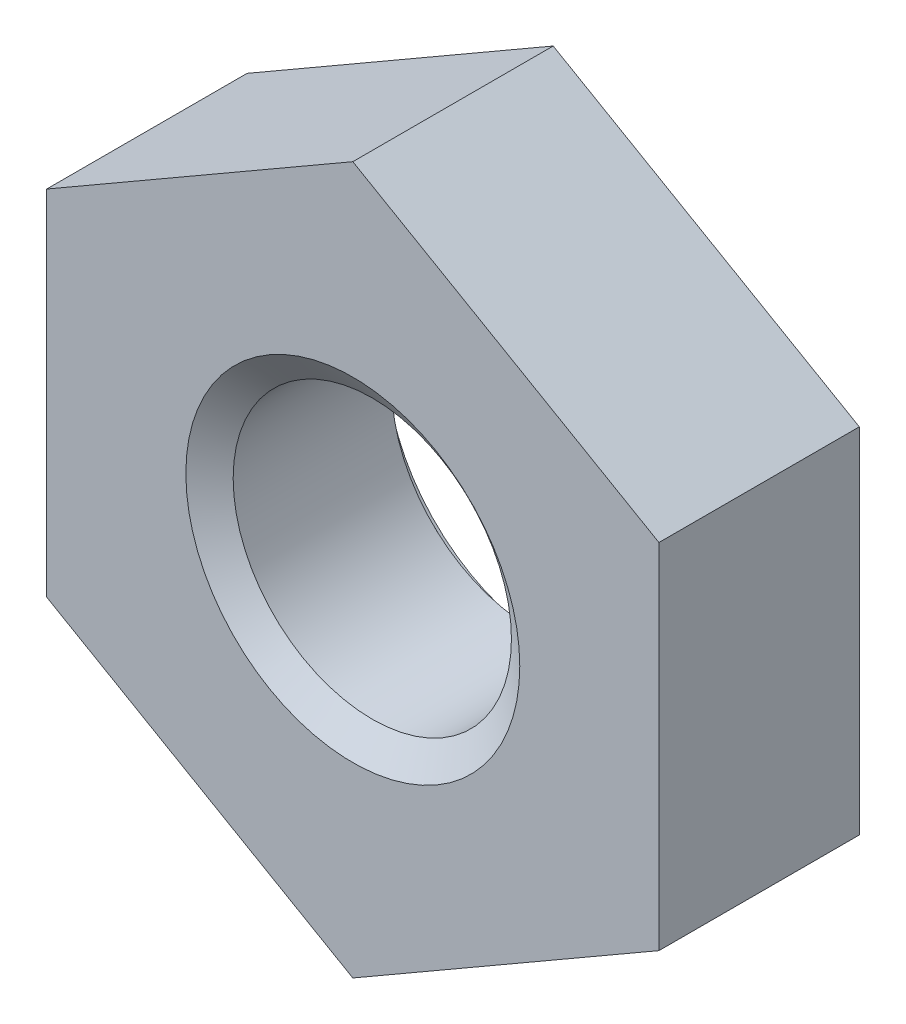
ISO-10303-21;
HEADER;
FILE_DESCRIPTION(('STEP AP214'),'2;1');
FILE_NAME('part.step','',(''),(''),'','','');
FILE_SCHEMA(('AUTOMOTIVE_DESIGN { 1 0 10303 214 1 1 1 1 }'));
ENDSEC;
DATA;
#1=APPLICATION_CONTEXT('core data for automotive mechanical design processes');
#2=APPLICATION_PROTOCOL_DEFINITION('international standard','automotive_design',2000,#1);
#3=PRODUCT_CONTEXT('',#1,'mechanical');
#4=PRODUCT('Part','Part','',(#3));
#5=PRODUCT_RELATED_PRODUCT_CATEGORY('part','',(#4));
#6=PRODUCT_DEFINITION_FORMATION('','',#4);
#7=PRODUCT_DEFINITION_CONTEXT('part definition',#1,'design');
#8=PRODUCT_DEFINITION('design','',#6,#7);
#9=PRODUCT_DEFINITION_SHAPE('','',#8);
#10=(LENGTH_UNIT() NAMED_UNIT(*) SI_UNIT(.MILLI.,.METRE.));
#11=(NAMED_UNIT(*) PLANE_ANGLE_UNIT() SI_UNIT($,.RADIAN.));
#12=(NAMED_UNIT(*) SI_UNIT($,.STERADIAN.) SOLID_ANGLE_UNIT());
#13=UNCERTAINTY_MEASURE_WITH_UNIT(LENGTH_MEASURE(1.E-05),#10,'distance_accuracy_value','');
#14=(GEOMETRIC_REPRESENTATION_CONTEXT(3) GLOBAL_UNCERTAINTY_ASSIGNED_CONTEXT((#13)) GLOBAL_UNIT_ASSIGNED_CONTEXT((#10,
#11,#12)) REPRESENTATION_CONTEXT('',''));
#15=CARTESIAN_POINT('',(0.,0.,0.));
#16=DIRECTION('',(0.,0.,1.));
#17=DIRECTION('',(1.,0.,0.));
#18=AXIS2_PLACEMENT_3D('',#15,#16,#17);
#19=CARTESIAN_POINT('',(0.,0.,-1.8));
#20=DIRECTION('',(0.,0.,1.));
#21=DIRECTION('',(1.,0.,0.));
#22=AXIS2_PLACEMENT_3D('',#19,#20,#21);
#23=CYLINDRICAL_SURFACE('',#22,1.25);
#24=CARTESIAN_POINT('',(0.,0.,-0.175051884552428));
#25=DIRECTION('',(0.,0.,1.));
#26=DIRECTION('',(1.,0.,0.));
#27=AXIS2_PLACEMENT_3D('',#24,#25,#26);
#28=CIRCLE('',#27,1.25);
#29=CARTESIAN_POINT('',(1.25,0.,-0.175051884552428));
#30=VERTEX_POINT('',#29);
#31=EDGE_CURVE('E112',#30,#30,#28,.F.);
#32=ORIENTED_EDGE('',*,*,#31,.F.);
#33=EDGE_LOOP('',(#32));
#34=FACE_BOUND('',#33,.T.);
#35=CARTESIAN_POINT('',(0.,0.,-1.59954811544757));
#36=DIRECTION('',(0.,0.,-1.));
#37=DIRECTION('',(-1.,0.,0.));
#38=AXIS2_PLACEMENT_3D('',#35,#36,#37);
#39=CIRCLE('',#38,1.25);
#40=CARTESIAN_POINT('',(-1.25,0.,-1.59954811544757));
#41=VERTEX_POINT('',#40);
#42=EDGE_CURVE('E41',#41,#41,#39,.F.);
#43=ORIENTED_EDGE('',*,*,#42,.F.);
#44=EDGE_LOOP('',(#43));
#45=FACE_BOUND('',#44,.T.);
#46=ADVANCED_FACE('F37',(#34,#45),#23,.F.);
#47=CARTESIAN_POINT('',(0.,3.17542648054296,-1.8));
#48=DIRECTION('',(0.,0.,-1.));
#49=DIRECTION('',(-1.,0.,0.));
#50=AXIS2_PLACEMENT_3D('',#47,#48,#49);
#51=PLANE('',#50);
#52=DIRECTION('',(-0.866025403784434,-0.500000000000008,0.));
#53=VECTOR('',#52,1.);
#54=CARTESIAN_POINT('',(0.,3.17542648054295,-1.8));
#55=LINE('',#54,#53);
#56=CARTESIAN_POINT('',(0.,3.17542648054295,-1.8));
#57=VERTEX_POINT('',#56);
#58=CARTESIAN_POINT('',(-2.75,1.58771324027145,-1.8));
#59=VERTEX_POINT('',#58);
#60=EDGE_CURVE('E93',#57,#59,#55,.T.);
#61=ORIENTED_EDGE('',*,*,#60,.F.);
#62=DIRECTION('',(-0.866025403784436,0.500000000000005,0.));
#63=VECTOR('',#62,1.);
#64=CARTESIAN_POINT('',(2.75,1.58771324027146,-1.8));
#65=LINE('',#64,#63);
#66=CARTESIAN_POINT('',(2.75,1.58771324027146,-1.8));
#67=VERTEX_POINT('',#66);
#68=EDGE_CURVE('E98',#67,#57,#65,.T.);
#69=ORIENTED_EDGE('',*,*,#68,.F.);
#70=DIRECTION('',(0.,-1.,0.));
#71=VECTOR('',#70,1.);
#72=CARTESIAN_POINT('',(2.75,1.58771324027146,-1.8));
#73=LINE('',#72,#71);
#74=CARTESIAN_POINT('',(2.75,-1.58771324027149,-1.8));
#75=VERTEX_POINT('',#74);
#76=EDGE_CURVE('E137',#67,#75,#73,.T.);
#77=ORIENTED_EDGE('',*,*,#76,.T.);
#78=DIRECTION('',(0.866025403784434,0.500000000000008,0.));
#79=VECTOR('',#78,1.);
#80=CARTESIAN_POINT('',(0.,-3.175426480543,-1.8));
#81=LINE('',#80,#79);
#82=CARTESIAN_POINT('',(0.,-3.175426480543,-1.8));
#83=VERTEX_POINT('',#82);
#84=EDGE_CURVE('E134',#83,#75,#81,.T.);
#85=ORIENTED_EDGE('',*,*,#84,.F.);
#86=DIRECTION('',(0.866025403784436,-0.500000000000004,0.));
#87=VECTOR('',#86,1.);
#88=CARTESIAN_POINT('',(-2.75,-1.58771324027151,-1.8));
#89=LINE('',#88,#87);
#90=CARTESIAN_POINT('',(-2.75,-1.58771324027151,-1.8));
#91=VERTEX_POINT('',#90);
#92=EDGE_CURVE('E131',#91,#83,#89,.T.);
#93=ORIENTED_EDGE('',*,*,#92,.F.);
#94=DIRECTION('',(0.,-1.,0.));
#95=VECTOR('',#94,1.);
#96=CARTESIAN_POINT('',(-2.75,1.58771324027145,-1.8));
#97=LINE('',#96,#95);
#98=EDGE_CURVE('E129',#59,#91,#97,.T.);
#99=ORIENTED_EDGE('',*,*,#98,.F.);
#100=EDGE_LOOP('',(#61,#69,#77,#85,#93,#99));
#101=FACE_BOUND('',#100,.T.);
#102=CARTESIAN_POINT('',(0.,0.,-1.8));
#103=DIRECTION('',(0.,0.,-1.));
#104=DIRECTION('',(-1.,0.,0.));
#105=AXIS2_PLACEMENT_3D('',#102,#103,#104);
#106=CIRCLE('',#105,1.5);
#107=CARTESIAN_POINT('',(-1.5,0.,-1.8));
#108=VERTEX_POINT('',#107);
#109=EDGE_CURVE('E145',#108,#108,#106,.F.);
#110=ORIENTED_EDGE('',*,*,#109,.T.);
#111=EDGE_LOOP('',(#110));
#112=FACE_BOUND('',#111,.T.);
#113=ADVANCED_FACE('F164',(#101,#112),#51,.T.);
#114=CARTESIAN_POINT('',(0.,3.17542648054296,0.));
#115=DIRECTION('',(0.,0.,-1.));
#116=DIRECTION('',(-1.,0.,0.));
#117=AXIS2_PLACEMENT_3D('',#114,#115,#116);
#118=PLANE('',#117);
#119=DIRECTION('',(-0.866025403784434,-0.500000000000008,0.));
#120=VECTOR('',#119,1.);
#121=CARTESIAN_POINT('',(0.,3.17542648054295,0.));
#122=LINE('',#121,#120);
#123=CARTESIAN_POINT('',(0.,3.17542648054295,0.));
#124=VERTEX_POINT('',#123);
#125=CARTESIAN_POINT('',(-2.75,1.58771324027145,0.));
#126=VERTEX_POINT('',#125);
#127=EDGE_CURVE('E91',#124,#126,#122,.T.);
#128=ORIENTED_EDGE('',*,*,#127,.T.);
#129=DIRECTION('',(0.,-1.,0.));
#130=VECTOR('',#129,1.);
#131=CARTESIAN_POINT('',(-2.75,1.58771324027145,0.));
#132=LINE('',#131,#130);
#133=CARTESIAN_POINT('',(-2.75,-1.58771324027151,0.));
#134=VERTEX_POINT('',#133);
#135=EDGE_CURVE('E101',#126,#134,#132,.T.);
#136=ORIENTED_EDGE('',*,*,#135,.T.);
#137=DIRECTION('',(0.866025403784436,-0.500000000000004,0.));
#138=VECTOR('',#137,1.);
#139=CARTESIAN_POINT('',(-2.75,-1.58771324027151,0.));
#140=LINE('',#139,#138);
#141=CARTESIAN_POINT('',(0.,-3.175426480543,0.));
#142=VERTEX_POINT('',#141);
#143=EDGE_CURVE('E106',#134,#142,#140,.T.);
#144=ORIENTED_EDGE('',*,*,#143,.T.);
#145=DIRECTION('',(0.866025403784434,0.500000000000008,0.));
#146=VECTOR('',#145,1.);
#147=CARTESIAN_POINT('',(0.,-3.175426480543,0.));
#148=LINE('',#147,#146);
#149=CARTESIAN_POINT('',(2.75,-1.58771324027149,0.));
#150=VERTEX_POINT('',#149);
#151=EDGE_CURVE('E121',#142,#150,#148,.T.);
#152=ORIENTED_EDGE('',*,*,#151,.T.);
#153=DIRECTION('',(0.,-1.,0.));
#154=VECTOR('',#153,1.);
#155=CARTESIAN_POINT('',(2.75,1.58771324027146,0.));
#156=LINE('',#155,#154);
#157=CARTESIAN_POINT('',(2.75,1.58771324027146,0.));
#158=VERTEX_POINT('',#157);
#159=EDGE_CURVE('E124',#158,#150,#156,.T.);
#160=ORIENTED_EDGE('',*,*,#159,.F.);
#161=DIRECTION('',(-0.866025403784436,0.500000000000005,0.));
#162=VECTOR('',#161,1.);
#163=CARTESIAN_POINT('',(2.75,1.58771324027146,0.));
#164=LINE('',#163,#162);
#165=EDGE_CURVE('E111',#158,#124,#164,.T.);
#166=ORIENTED_EDGE('',*,*,#165,.T.);
#167=EDGE_LOOP('',(#128,#136,#144,#152,#160,#166));
#168=FACE_BOUND('',#167,.T.);
#169=CARTESIAN_POINT('',(0.,0.,0.));
#170=DIRECTION('',(0.,0.,1.));
#171=DIRECTION('',(1.,0.,0.));
#172=AXIS2_PLACEMENT_3D('',#169,#170,#171);
#173=CIRCLE('',#172,1.5);
#174=CARTESIAN_POINT('',(1.5,0.,0.));
#175=VERTEX_POINT('',#174);
#176=EDGE_CURVE('E115',#175,#175,#173,.T.);
#177=ORIENTED_EDGE('',*,*,#176,.F.);
#178=EDGE_LOOP('',(#177));
#179=FACE_BOUND('',#178,.T.);
#180=ADVANCED_FACE('F108',(#168,#179),#118,.F.);
#181=CARTESIAN_POINT('',(0.,3.17542648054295,-1.8));
#182=DIRECTION('',(-0.500000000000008,0.866025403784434,0.));
#183=DIRECTION('',(-0.866025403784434,-0.500000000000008,0.));
#184=AXIS2_PLACEMENT_3D('',#181,#182,#183);
#185=PLANE('',#184);
#186=ORIENTED_EDGE('',*,*,#127,.F.);
#187=DIRECTION('',(0.,0.,1.));
#188=VECTOR('',#187,1.);
#189=CARTESIAN_POINT('',(0.,3.17542648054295,-1.8));
#190=LINE('',#189,#188);
#191=EDGE_CURVE('E11',#57,#124,#190,.T.);
#192=ORIENTED_EDGE('',*,*,#191,.F.);
#193=ORIENTED_EDGE('',*,*,#60,.T.);
#194=DIRECTION('',(0.,0.,1.));
#195=VECTOR('',#194,1.);
#196=CARTESIAN_POINT('',(-2.75,1.58771324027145,-1.8));
#197=LINE('',#196,#195);
#198=EDGE_CURVE('E88',#59,#126,#197,.T.);
#199=ORIENTED_EDGE('',*,*,#198,.T.);
#200=EDGE_LOOP('',(#186,#192,#193,#199));
#201=FACE_BOUND('',#200,.T.);
#202=ADVANCED_FACE('F39',(#201),#185,.T.);
#203=CARTESIAN_POINT('',(2.75,1.58771324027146,-1.8));
#204=DIRECTION('',(0.500000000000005,0.866025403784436,0.));
#205=DIRECTION('',(-0.866025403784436,0.500000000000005,0.));
#206=AXIS2_PLACEMENT_3D('',#203,#204,#205);
#207=PLANE('',#206);
#208=ORIENTED_EDGE('',*,*,#165,.F.);
#209=DIRECTION('',(0.,0.,1.));
#210=VECTOR('',#209,1.);
#211=CARTESIAN_POINT('',(2.75,1.58771324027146,-1.8));
#212=LINE('',#211,#210);
#213=EDGE_CURVE('E46',#67,#158,#212,.T.);
#214=ORIENTED_EDGE('',*,*,#213,.F.);
#215=ORIENTED_EDGE('',*,*,#68,.T.);
#216=ORIENTED_EDGE('',*,*,#191,.T.);
#217=EDGE_LOOP('',(#208,#214,#215,#216));
#218=FACE_BOUND('',#217,.T.);
#219=ADVANCED_FACE('F178',(#218),#207,.T.);
#220=CARTESIAN_POINT('',(2.75,1.58771324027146,-1.8));
#221=DIRECTION('',(-1.,0.,0.));
#222=DIRECTION('',(0.,0.,1.));
#223=AXIS2_PLACEMENT_3D('',#220,#221,#222);
#224=PLANE('',#223);
#225=ORIENTED_EDGE('',*,*,#159,.T.);
#226=DIRECTION('',(0.,0.,1.));
#227=VECTOR('',#226,1.);
#228=CARTESIAN_POINT('',(2.75,-1.58771324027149,-1.8));
#229=LINE('',#228,#227);
#230=EDGE_CURVE('E141',#75,#150,#229,.T.);
#231=ORIENTED_EDGE('',*,*,#230,.F.);
#232=ORIENTED_EDGE('',*,*,#76,.F.);
#233=ORIENTED_EDGE('',*,*,#213,.T.);
#234=EDGE_LOOP('',(#225,#231,#232,#233));
#235=FACE_BOUND('',#234,.T.);
#236=ADVANCED_FACE('F181',(#235),#224,.F.);
#237=CARTESIAN_POINT('',(0.,-3.175426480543,-1.8));
#238=DIRECTION('',(0.500000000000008,-0.866025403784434,0.));
#239=DIRECTION('',(0.866025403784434,0.500000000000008,0.));
#240=AXIS2_PLACEMENT_3D('',#237,#238,#239);
#241=PLANE('',#240);
#242=ORIENTED_EDGE('',*,*,#151,.F.);
#243=DIRECTION('',(0.,0.,1.));
#244=VECTOR('',#243,1.);
#245=CARTESIAN_POINT('',(0.,-3.175426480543,-1.8));
#246=LINE('',#245,#244);
#247=EDGE_CURVE('E143',#83,#142,#246,.T.);
#248=ORIENTED_EDGE('',*,*,#247,.F.);
#249=ORIENTED_EDGE('',*,*,#84,.T.);
#250=ORIENTED_EDGE('',*,*,#230,.T.);
#251=EDGE_LOOP('',(#242,#248,#249,#250));
#252=FACE_BOUND('',#251,.T.);
#253=ADVANCED_FACE('F184',(#252),#241,.T.);
#254=CARTESIAN_POINT('',(-2.75,-1.58771324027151,-1.8));
#255=DIRECTION('',(-0.500000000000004,-0.866025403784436,0.));
#256=DIRECTION('',(0.866025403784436,-0.500000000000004,0.));
#257=AXIS2_PLACEMENT_3D('',#254,#255,#256);
#258=PLANE('',#257);
#259=ORIENTED_EDGE('',*,*,#143,.F.);
#260=DIRECTION('',(0.,0.,1.));
#261=VECTOR('',#260,1.);
#262=CARTESIAN_POINT('',(-2.75,-1.58771324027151,-1.8));
#263=LINE('',#262,#261);
#264=EDGE_CURVE('E97',#91,#134,#263,.T.);
#265=ORIENTED_EDGE('',*,*,#264,.F.);
#266=ORIENTED_EDGE('',*,*,#92,.T.);
#267=ORIENTED_EDGE('',*,*,#247,.T.);
#268=EDGE_LOOP('',(#259,#265,#266,#267));
#269=FACE_BOUND('',#268,.T.);
#270=ADVANCED_FACE('F188',(#269),#258,.T.);
#271=CARTESIAN_POINT('',(-2.75,1.58771324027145,-1.8));
#272=DIRECTION('',(-1.,0.,0.));
#273=DIRECTION('',(0.,0.,1.));
#274=AXIS2_PLACEMENT_3D('',#271,#272,#273);
#275=PLANE('',#274);
#276=ORIENTED_EDGE('',*,*,#135,.F.);
#277=ORIENTED_EDGE('',*,*,#198,.F.);
#278=ORIENTED_EDGE('',*,*,#98,.T.);
#279=ORIENTED_EDGE('',*,*,#264,.T.);
#280=EDGE_LOOP('',(#276,#277,#278,#279));
#281=FACE_BOUND('',#280,.T.);
#282=ADVANCED_FACE('F102',(#281),#275,.T.);
#283=CARTESIAN_POINT('',(0.,0.,-0.192557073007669));
#284=DIRECTION('',(0.,0.,1.));
#285=DIRECTION('',(1.,0.,0.));
#286=AXIS2_PLACEMENT_3D('',#283,#284,#285);
#287=CONICAL_SURFACE('',#286,1.225,0.95993108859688);
#288=ORIENTED_EDGE('',*,*,#176,.T.);
#289=EDGE_LOOP('',(#288));
#290=FACE_BOUND('',#289,.T.);
#291=ORIENTED_EDGE('',*,*,#31,.T.);
#292=EDGE_LOOP('',(#291));
#293=FACE_BOUND('',#292,.T.);
#294=ADVANCED_FACE('F159',(#290,#293),#287,.F.);
#295=CARTESIAN_POINT('',(0.,0.,-1.7746));
#296=DIRECTION('',(0.,0.,-1.));
#297=DIRECTION('',(-1.,0.,0.));
#298=AXIS2_PLACEMENT_3D('',#295,#296,#297);
#299=CONICAL_SURFACE('',#298,1.5,0.95993108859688);
#300=CARTESIAN_POINT('',(0.,0.,-1.7746));
#301=DIRECTION('',(0.,0.,1.));
#302=DIRECTION('',(1.,0.,0.));
#303=AXIS2_PLACEMENT_3D('',#300,#301,#302);
#304=CIRCLE('',#303,1.5);
#305=CARTESIAN_POINT('',(1.5,0.,-1.7746));
#306=VERTEX_POINT('',#305);
#307=EDGE_CURVE('E147',#306,#306,#304,.T.);
#308=ORIENTED_EDGE('',*,*,#307,.F.);
#309=EDGE_LOOP('',(#308));
#310=FACE_BOUND('',#309,.T.);
#311=ORIENTED_EDGE('',*,*,#42,.T.);
#312=EDGE_LOOP('',(#311));
#313=FACE_BOUND('',#312,.T.);
#314=ADVANCED_FACE('F156',(#310,#313),#299,.F.);
#315=CARTESIAN_POINT('',(0.,0.,-25.0375057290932));
#316=DIRECTION('',(0.,0.,1.));
#317=DIRECTION('',(1.,0.,0.));
#318=AXIS2_PLACEMENT_3D('',#315,#316,#317);
#319=CYLINDRICAL_SURFACE('',#318,1.5);
#320=ORIENTED_EDGE('',*,*,#109,.F.);
#321=EDGE_LOOP('',(#320));
#322=FACE_BOUND('',#321,.T.);
#323=ORIENTED_EDGE('',*,*,#307,.T.);
#324=EDGE_LOOP('',(#323));
#325=FACE_BOUND('',#324,.T.);
#326=ADVANCED_FACE('F154',(#322,#325),#319,.F.);
#327=CLOSED_SHELL('',(#46,#113,#180,#202,#219,#236,#253,#270,#282,#294,#314,#326));
#328=MANIFOLD_SOLID_BREP('B2',#327);
#329=ADVANCED_BREP_SHAPE_REPRESENTATION('',(#18,#328),#14);
#330=SHAPE_DEFINITION_REPRESENTATION(#9,#329);
ENDSEC;
END-ISO-10303-21;
